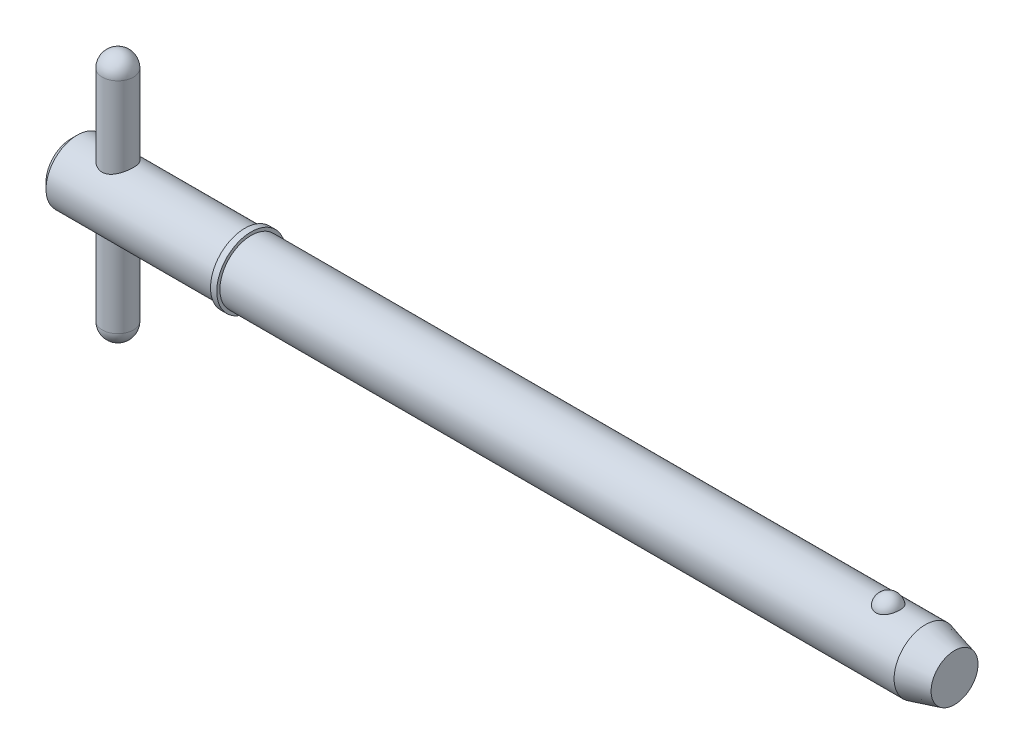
ISO-10303-21;
HEADER;
FILE_DESCRIPTION(('STEP AP214'),'2;1');
FILE_NAME('part.step','',(''),(''),'','','');
FILE_SCHEMA(('AUTOMOTIVE_DESIGN { 1 0 10303 214 1 1 1 1 }'));
ENDSEC;
DATA;
#1=APPLICATION_CONTEXT('core data for automotive mechanical design processes');
#2=APPLICATION_PROTOCOL_DEFINITION('international standard','automotive_design',2000,#1);
#3=PRODUCT_CONTEXT('',#1,'mechanical');
#4=PRODUCT('Part','Part','',(#3));
#5=PRODUCT_RELATED_PRODUCT_CATEGORY('part','',(#4));
#6=PRODUCT_DEFINITION_FORMATION('','',#4);
#7=PRODUCT_DEFINITION_CONTEXT('part definition',#1,'design');
#8=PRODUCT_DEFINITION('design','',#6,#7);
#9=PRODUCT_DEFINITION_SHAPE('','',#8);
#10=(LENGTH_UNIT() NAMED_UNIT(*) SI_UNIT(.MILLI.,.METRE.));
#11=(NAMED_UNIT(*) PLANE_ANGLE_UNIT() SI_UNIT($,.RADIAN.));
#12=(NAMED_UNIT(*) SI_UNIT($,.STERADIAN.) SOLID_ANGLE_UNIT());
#13=UNCERTAINTY_MEASURE_WITH_UNIT(LENGTH_MEASURE(1.E-05),#10,'distance_accuracy_value','');
#14=(GEOMETRIC_REPRESENTATION_CONTEXT(3) GLOBAL_UNCERTAINTY_ASSIGNED_CONTEXT((#13)) GLOBAL_UNIT_ASSIGNED_CONTEXT((#10,
#11,#12)) REPRESENTATION_CONTEXT('',''));
#15=CARTESIAN_POINT('',(0.,0.,0.));
#16=DIRECTION('',(0.,0.,1.));
#17=DIRECTION('',(1.,0.,0.));
#18=AXIS2_PLACEMENT_3D('',#15,#16,#17);
#19=CARTESIAN_POINT('',(4.755,12.7,0.));
#20=DIRECTION('',(0.,-1.,0.));
#21=DIRECTION('',(0.,0.,-1.));
#22=AXIS2_PLACEMENT_3D('',#19,#20,#21);
#23=CYLINDRICAL_SURFACE('',#22,1.585);
#24=CARTESIAN_POINT('',(4.755,-11.115,0.));
#25=DIRECTION('',(0.,-1.,0.));
#26=DIRECTION('',(0.,0.,-1.));
#27=AXIS2_PLACEMENT_3D('',#24,#25,#26);
#28=CIRCLE('',#27,1.585);
#29=CARTESIAN_POINT('',(4.755,-11.115,-1.585));
#30=VERTEX_POINT('',#29);
#31=EDGE_CURVE('P0_E10',#30,#30,#28,.F.);
#32=ORIENTED_EDGE('',*,*,#31,.T.);
#33=EDGE_LOOP('',(#32));
#34=FACE_BOUND('',#33,.T.);
#35=CARTESIAN_POINT('',(4.755,11.115,0.));
#36=DIRECTION('',(0.,-1.,0.));
#37=DIRECTION('',(0.,0.,-1.));
#38=AXIS2_PLACEMENT_3D('',#35,#36,#37);
#39=CIRCLE('',#38,1.585);
#40=CARTESIAN_POINT('',(4.755,11.115,-1.585));
#41=VERTEX_POINT('',#40);
#42=EDGE_CURVE('P0_E21',#41,#41,#39,.T.);
#43=ORIENTED_EDGE('',*,*,#42,.T.);
#44=EDGE_LOOP('',(#43));
#45=FACE_BOUND('',#44,.T.);
#46=ADVANCED_FACE('P0_F14',(#34,#45),#23,.T.);
#47=CARTESIAN_POINT('',(4.755,-11.115,0.));
#48=DIRECTION('',(0.,0.,1.));
#49=DIRECTION('',(1.,0.,0.));
#50=AXIS2_PLACEMENT_3D('',#47,#48,#49);
#51=SPHERICAL_SURFACE('',#50,1.585);
#52=CARTESIAN_POINT('',(4.755,-11.115,0.));
#53=DIRECTION('',(0.,-1.,0.));
#54=DIRECTION('',(0.,0.,-1.));
#55=AXIS2_PLACEMENT_3D('',#52,#53,#54);
#56=SPHERICAL_SURFACE('',#55,1.585);
#57=ORIENTED_EDGE('',*,*,#31,.F.);
#58=EDGE_LOOP('',(#57));
#59=FACE_BOUND('',#58,.T.);
#60=ADVANCED_FACE('P0_F29',(#59),#56,.T.);
#61=CARTESIAN_POINT('',(4.755,11.115,0.));
#62=DIRECTION('',(0.,0.,1.));
#63=DIRECTION('',(1.,0.,0.));
#64=AXIS2_PLACEMENT_3D('',#61,#62,#63);
#65=SPHERICAL_SURFACE('',#64,1.585);
#66=CARTESIAN_POINT('',(4.755,11.115,0.));
#67=DIRECTION('',(0.,-1.,0.));
#68=DIRECTION('',(0.,0.,-1.));
#69=AXIS2_PLACEMENT_3D('',#66,#67,#68);
#70=SPHERICAL_SURFACE('',#69,1.585);
#71=ORIENTED_EDGE('',*,*,#42,.F.);
#72=EDGE_LOOP('',(#71));
#73=FACE_BOUND('',#72,.T.);
#74=ADVANCED_FACE('P0_F16',(#73),#70,.T.);
#75=CLOSED_SHELL('',(#46,#60,#74));
#76=MANIFOLD_SOLID_BREP('P0_B1',#75);
#77=CARTESIAN_POINT('',(0.,0.,0.));
#78=DIRECTION('',(1.,0.,0.));
#79=DIRECTION('',(0.,0.,-1.));
#80=AXIS2_PLACEMENT_3D('',#77,#78,#79);
#81=CYLINDRICAL_SURFACE('',#80,3.175);
#82=CARTESIAN_POINT('',(86.7476846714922,0.,0.));
#83=DIRECTION('',(1.,0.,0.));
#84=DIRECTION('',(0.,0.,-1.));
#85=AXIS2_PLACEMENT_3D('',#82,#83,#84);
#86=CIRCLE('',#85,3.175);
#87=CARTESIAN_POINT('',(86.7476846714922,0.,-3.175));
#88=VERTEX_POINT('',#87);
#89=EDGE_CURVE('P1_E81',#88,#88,#86,.T.);
#90=ORIENTED_EDGE('',*,*,#89,.F.);
#91=EDGE_LOOP('',(#90));
#92=FACE_BOUND('',#91,.T.);
#93=CARTESIAN_POINT('',(18.29,0.,0.));
#94=DIRECTION('',(1.,0.,0.));
#95=DIRECTION('',(0.,0.,-1.));
#96=AXIS2_PLACEMENT_3D('',#93,#94,#95);
#97=CIRCLE('',#96,3.175);
#98=CARTESIAN_POINT('',(18.29,0.,-3.175));
#99=VERTEX_POINT('',#98);
#100=EDGE_CURVE('P1_E85',#99,#99,#97,.T.);
#101=ORIENTED_EDGE('',*,*,#100,.T.);
#102=EDGE_LOOP('',(#101));
#103=FACE_BOUND('',#102,.T.);
#104=CARTESIAN_POINT('',(82.9757276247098,2.92898950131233,1.2254164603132));
#105=CARTESIAN_POINT('',(82.912316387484,2.92899434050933,1.22541146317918));
#106=CARTESIAN_POINT('',(82.8487979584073,2.93112688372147,1.2203464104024));
#107=CARTESIAN_POINT('',(82.7235306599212,2.93942752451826,1.20020949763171));
#108=CARTESIAN_POINT('',(82.6617869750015,2.9456063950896,1.1851109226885));
#109=CARTESIAN_POINT('',(82.5420651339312,2.96127115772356,1.14540352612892));
#110=CARTESIAN_POINT('',(82.4840775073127,2.97074831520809,1.12081980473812));
#111=CARTESIAN_POINT('',(82.3731943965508,2.99197584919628,1.06285154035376));
#112=CARTESIAN_POINT('',(82.3202966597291,3.0037252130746,1.02947091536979));
#113=CARTESIAN_POINT('',(82.2192688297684,3.02865714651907,0.953674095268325));
#114=CARTESIAN_POINT('',(82.171324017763,3.04187163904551,0.911021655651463));
#115=CARTESIAN_POINT('',(82.0830360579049,3.06808741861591,0.818400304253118));
#116=CARTESIAN_POINT('',(82.0426952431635,3.08108863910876,0.768429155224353));
#117=CARTESIAN_POINT('',(81.9688039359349,3.10614903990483,0.660064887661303));
#118=CARTESIAN_POINT('',(81.9356330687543,3.11814104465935,0.601396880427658));
#119=CARTESIAN_POINT('',(81.8791190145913,3.13926931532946,0.479026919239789));
#120=CARTESIAN_POINT('',(81.8557764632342,3.14840539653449,0.415324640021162));
#121=CARTESIAN_POINT('',(81.8191785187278,3.16298160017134,0.283885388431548));
#122=CARTESIAN_POINT('',(81.8060407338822,3.16837855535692,0.216110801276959));
#123=CARTESIAN_POINT('',(81.7905676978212,3.17475386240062,0.0791367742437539));
#124=CARTESIAN_POINT('',(81.788232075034,3.17573236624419,0.00993738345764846));
#125=CARTESIAN_POINT('',(81.794388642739,3.17318075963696,-0.127420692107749));
#126=CARTESIAN_POINT('',(81.8028073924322,3.16968122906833,-0.19558325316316));
#127=CARTESIAN_POINT('',(81.8301752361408,3.1585790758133,-0.329413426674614));
#128=CARTESIAN_POINT('',(81.8491245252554,3.15097637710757,-0.395080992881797));
#129=CARTESIAN_POINT('',(81.8972057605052,3.13242485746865,-0.5221806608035));
#130=CARTESIAN_POINT('',(81.9263524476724,3.12147119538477,-0.583606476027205));
#131=CARTESIAN_POINT('',(81.9942352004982,3.09734973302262,-0.700436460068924));
#132=CARTESIAN_POINT('',(82.032972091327,3.08418174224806,-0.755840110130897));
#133=CARTESIAN_POINT('',(82.1194771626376,3.05694884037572,-0.859404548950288));
#134=CARTESIAN_POINT('',(82.1672961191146,3.04287919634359,-0.907521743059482));
#135=CARTESIAN_POINT('',(82.2707353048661,3.01548927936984,-0.994758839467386));
#136=CARTESIAN_POINT('',(82.3263549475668,3.0021689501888,-1.03387941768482));
#137=CARTESIAN_POINT('',(82.4428093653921,2.97810316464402,-1.10126594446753));
#138=CARTESIAN_POINT('',(82.5035182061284,2.96731170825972,-1.12973256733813));
#139=CARTESIAN_POINT('',(82.6293712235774,2.94928934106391,-1.17598467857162));
#140=CARTESIAN_POINT('',(82.6945137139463,2.94205708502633,-1.19377420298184));
#141=CARTESIAN_POINT('',(82.8238562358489,2.93233065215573,-1.21746387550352));
#142=CARTESIAN_POINT('',(82.8879385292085,2.92961621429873,-1.22391763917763));
#143=CARTESIAN_POINT('',(83.0163375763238,2.92855752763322,-1.22644976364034));
#144=CARTESIAN_POINT('',(83.0806542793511,2.93021238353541,-1.22253024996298));
#145=CARTESIAN_POINT('',(83.2055239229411,2.9375685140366,-1.20474140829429));
#146=CARTESIAN_POINT('',(83.266131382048,2.94313790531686,-1.19119621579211));
#147=CARTESIAN_POINT('',(83.3841106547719,2.95756226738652,-1.15491492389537));
#148=CARTESIAN_POINT('',(83.4414822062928,2.96641750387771,-1.13217808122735));
#149=CARTESIAN_POINT('',(83.5527699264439,2.98669918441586,-1.07755083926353));
#150=CARTESIAN_POINT('',(83.6065845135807,2.9981771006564,-1.0454730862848));
#151=CARTESIAN_POINT('',(83.7081473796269,3.02240235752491,-0.97322030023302));
#152=CARTESIAN_POINT('',(83.7558942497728,3.03514999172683,-0.933043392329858));
#153=CARTESIAN_POINT('',(83.8465817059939,3.06131230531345,-0.843372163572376));
#154=CARTESIAN_POINT('',(83.8891588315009,3.07472822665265,-0.793510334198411));
#155=CARTESIAN_POINT('',(83.9656765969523,3.10021106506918,-0.687241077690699));
#156=CARTESIAN_POINT('',(83.9996156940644,3.1122777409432,-0.630832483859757));
#157=CARTESIAN_POINT('',(84.0591209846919,3.134208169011,-0.51105938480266));
#158=CARTESIAN_POINT('',(84.0843892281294,3.14399040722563,-0.447531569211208));
#159=CARTESIAN_POINT('',(84.1245117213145,3.15983820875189,-0.31682749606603));
#160=CARTESIAN_POINT('',(84.1393659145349,3.16590375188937,-0.249651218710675));
#161=CARTESIAN_POINT('',(84.158358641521,3.17370076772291,-0.113549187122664));
#162=CARTESIAN_POINT('',(84.1624966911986,3.17543204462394,-0.0446233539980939));
#163=CARTESIAN_POINT('',(84.1599697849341,3.17438372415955,0.0929938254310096));
#164=CARTESIAN_POINT('',(84.1533050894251,3.17160423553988,0.16168517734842));
#165=CARTESIAN_POINT('',(84.1293754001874,3.1618438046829,0.296502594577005));
#166=CARTESIAN_POINT('',(84.1121674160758,3.15488546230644,0.362640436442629));
#167=CARTESIAN_POINT('',(84.067547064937,3.13748892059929,0.490896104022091));
#168=CARTESIAN_POINT('',(84.0401339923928,3.12705048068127,0.553013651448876));
#169=CARTESIAN_POINT('',(83.9754626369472,3.10369139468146,0.671876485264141));
#170=CARTESIAN_POINT('',(83.9381467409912,3.0907563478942,0.728587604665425));
#171=CARTESIAN_POINT('',(83.8545246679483,3.06381731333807,0.834653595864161));
#172=CARTESIAN_POINT('',(83.8082189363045,3.04981337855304,0.884008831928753));
#173=CARTESIAN_POINT('',(83.707718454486,3.02230423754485,0.973916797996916));
#174=CARTESIAN_POINT('',(83.653535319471,3.00879833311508,1.01448227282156));
#175=CARTESIAN_POINT('',(83.5385299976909,2.98383625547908,1.0857155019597));
#176=CARTESIAN_POINT('',(83.4777053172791,2.9723808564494,1.11637952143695));
#177=CARTESIAN_POINT('',(83.3533690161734,2.95329063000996,1.16592590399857));
#178=CARTESIAN_POINT('',(83.2900230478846,2.9455373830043,1.18517901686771));
#179=CARTESIAN_POINT('',(83.1607664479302,2.9342556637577,1.21284802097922));
#180=CARTESIAN_POINT('',(83.0948641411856,2.93071450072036,1.2212964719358));
#181=CARTESIAN_POINT('',(83.011116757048,2.9291525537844,1.22502505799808));
#182=CARTESIAN_POINT('',(82.9934263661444,2.92898815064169,1.22541785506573));
#183=CARTESIAN_POINT('',(82.9757276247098,2.92898950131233,1.2254164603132));
#184=B_SPLINE_CURVE_WITH_KNOTS('',3,(#104,#105,#106,#107,#108,#109,#110,#111,#112,#113,#114,
#115,#116,#117,#118,#119,#120,#121,#122,#123,#124,#125,#126,#127,#128,#129,#130,#131,#132,#133,
#134,#135,#136,#137,#138,#139,#140,#141,#142,#143,#144,#145,#146,#147,#148,#149,#150,#151,#152,
#153,#154,#155,#156,#157,#158,#159,#160,#161,#162,#163,#164,#165,#166,#167,#168,#169,#170,#171,
#172,#173,#174,#175,#176,#177,#178,#179,#180,#181,#182,#183),.UNSPECIFIED.,.T.,.F.,(4,2,2,2,2,2,
2,2,2,2,2,2,2,2,2,2,2,2,2,2,2,2,2,2,2,2,2,2,2,2,2,2,2,2,2,2,2,2,2,4),(0.,0.190186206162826,
0.380880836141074,0.571074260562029,0.761183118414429,0.956866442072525,1.15260970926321,
1.3570177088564,1.56143892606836,1.76818248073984,1.97491892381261,2.18025109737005,
2.38558707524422,2.59122111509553,2.79687285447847,3.00371012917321,3.2105318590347,
3.41323429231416,3.61586005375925,3.80828192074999,4.00066436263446,4.18685798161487,
4.37306665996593,4.56330302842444,4.75358348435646,4.95345287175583,5.15335793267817,
5.35957003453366,5.56578325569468,5.7720057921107,5.97822335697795,6.183335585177,
6.38846199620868,6.59480900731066,6.80114579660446,7.00718137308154,7.21329457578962,
7.41228022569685,7.61066481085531,7.66374777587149),.UNSPECIFIED.);
#185=CARTESIAN_POINT('',(82.9757276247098,2.92898950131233,1.2254164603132));
#186=VERTEX_POINT('',#185);
#187=EDGE_CURVE('P1_E35',#186,#186,#184,.T.);
#188=ORIENTED_EDGE('',*,*,#187,.T.);
#189=EDGE_LOOP('',(#188));
#190=FACE_BOUND('',#189,.T.);
#191=ADVANCED_FACE('P1_F13',(#92,#103,#190),#81,.T.);
#192=CARTESIAN_POINT('',(0.,0.,0.));
#193=DIRECTION('',(-1.,0.,0.));
#194=DIRECTION('',(0.,0.,1.));
#195=AXIS2_PLACEMENT_3D('',#192,#193,#194);
#196=PLANE('',#195);
#197=CARTESIAN_POINT('',(0.,0.,0.));
#198=DIRECTION('',(1.,0.,0.));
#199=DIRECTION('',(0.,0.,-1.));
#200=AXIS2_PLACEMENT_3D('',#197,#198,#199);
#201=CIRCLE('',#200,2.54);
#202=CARTESIAN_POINT('',(0.,0.,-2.54));
#203=VERTEX_POINT('',#202);
#204=EDGE_CURVE('P1_E9',#203,#203,#201,.T.);
#205=ORIENTED_EDGE('',*,*,#204,.F.);
#206=EDGE_LOOP('',(#205));
#207=FACE_BOUND('',#206,.T.);
#208=ADVANCED_FACE('P1_F15',(#207),#196,.T.);
#209=CARTESIAN_POINT('',(0.634999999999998,0.,0.));
#210=DIRECTION('',(1.,0.,0.));
#211=DIRECTION('',(0.,0.,-1.));
#212=AXIS2_PLACEMENT_3D('',#209,#210,#211);
#213=CONICAL_SURFACE('',#212,3.175,0.78539816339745);
#214=ORIENTED_EDGE('',*,*,#204,.T.);
#215=EDGE_LOOP('',(#214));
#216=FACE_BOUND('',#215,.T.);
#217=CARTESIAN_POINT('',(0.634999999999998,0.,0.));
#218=DIRECTION('',(1.,0.,0.));
#219=DIRECTION('',(0.,0.,-1.));
#220=AXIS2_PLACEMENT_3D('',#217,#218,#219);
#221=CIRCLE('',#220,3.175);
#222=CARTESIAN_POINT('',(0.634999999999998,0.,-3.175));
#223=VERTEX_POINT('',#222);
#224=EDGE_CURVE('P1_E26',#223,#223,#221,.T.);
#225=ORIENTED_EDGE('',*,*,#224,.F.);
#226=EDGE_LOOP('',(#225));
#227=FACE_BOUND('',#226,.T.);
#228=ADVANCED_FACE('P1_F77',(#216,#227),#213,.T.);
#229=CARTESIAN_POINT('',(0.,0.,0.));
#230=DIRECTION('',(1.,0.,0.));
#231=DIRECTION('',(0.,0.,-1.));
#232=AXIS2_PLACEMENT_3D('',#229,#230,#231);
#233=CYLINDRICAL_SURFACE('',#232,3.175);
#234=CARTESIAN_POINT('',(4.755,-2.75107251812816,1.585));
#235=CARTESIAN_POINT('',(4.67238891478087,-2.7510796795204,1.58499425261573));
#236=CARTESIAN_POINT('',(4.58967306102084,-2.75485010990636,1.57849830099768));
#237=CARTESIAN_POINT('',(4.42677850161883,-2.76938647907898,1.55284486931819));
#238=CARTESIAN_POINT('',(4.34660551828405,-2.78016716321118,1.53366069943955));
#239=CARTESIAN_POINT('',(4.19146029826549,-2.80716278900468,1.48366329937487));
#240=CARTESIAN_POINT('',(4.11646293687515,-2.8233488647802,1.45291173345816));
#241=CARTESIAN_POINT('',(3.97271079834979,-2.85928672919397,1.38084067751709));
#242=CARTESIAN_POINT('',(3.90395634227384,-2.87903870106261,1.33952064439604));
#243=CARTESIAN_POINT('',(3.76839976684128,-2.921867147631,1.24350234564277));
#244=CARTESIAN_POINT('',(3.702222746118,-2.94508343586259,1.18798355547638));
#245=CARTESIAN_POINT('',(3.5796334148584,-2.99109588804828,1.06685014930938));
#246=CARTESIAN_POINT('',(3.52322596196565,-3.01389183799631,1.00123054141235));
#247=CARTESIAN_POINT('',(3.41807024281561,-3.05832598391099,0.856373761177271));
#248=CARTESIAN_POINT('',(3.37009053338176,-3.07978367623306,0.776518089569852));
#249=CARTESIAN_POINT('',(3.28853137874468,-3.11730894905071,0.608596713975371));
#250=CARTESIAN_POINT('',(3.25494287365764,-3.1333799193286,0.520536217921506));
#251=CARTESIAN_POINT('',(3.20559401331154,-3.15731341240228,0.345327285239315));
#252=CARTESIAN_POINT('',(3.18873760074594,-3.16567752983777,0.258557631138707));
#253=CARTESIAN_POINT('',(3.16972238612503,-3.17512718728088,0.0830496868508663));
#254=CARTESIAN_POINT('',(3.16755472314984,-3.17621711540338,-0.00568738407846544));
#255=CARTESIAN_POINT('',(3.1775542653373,-3.17123385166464,-0.174372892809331));
#256=CARTESIAN_POINT('',(3.18849502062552,-3.16577346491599,-0.254416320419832));
#257=CARTESIAN_POINT('',(3.22220680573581,-3.14922844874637,-0.411354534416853));
#258=CARTESIAN_POINT('',(3.2449787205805,-3.13814339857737,-0.488249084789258));
#259=CARTESIAN_POINT('',(3.30185558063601,-3.111172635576,-0.638050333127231));
#260=CARTESIAN_POINT('',(3.33611332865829,-3.09522247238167,-0.710886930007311));
#261=CARTESIAN_POINT('',(3.41477890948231,-3.05996035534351,-0.849953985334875));
#262=CARTESIAN_POINT('',(3.45919037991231,-3.04064719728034,-0.916182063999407));
#263=CARTESIAN_POINT('',(3.5617148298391,-2.99832415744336,-1.04681642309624));
#264=CARTESIAN_POINT('',(3.62072497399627,-2.97513741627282,-1.11046186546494));
#265=CARTESIAN_POINT('',(3.7483697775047,-2.92885066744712,-1.22736291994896));
#266=CARTESIAN_POINT('',(3.81701173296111,-2.90575073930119,-1.2806105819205));
#267=CARTESIAN_POINT('',(3.96727993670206,-2.86067370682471,-1.37849835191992));
#268=CARTESIAN_POINT('',(4.04945242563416,-2.83885964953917,-1.42238246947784));
#269=CARTESIAN_POINT('',(4.2213558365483,-2.80110454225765,-1.49537418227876));
#270=CARTESIAN_POINT('',(4.3110787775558,-2.78515738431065,-1.52449715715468));
#271=CARTESIAN_POINT('',(4.48806324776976,-2.76271292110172,-1.56478065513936));
#272=CARTESIAN_POINT('',(4.57495732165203,-2.75556745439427,-1.57718067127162));
#273=CARTESIAN_POINT('',(4.74985771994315,-2.74969306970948,-1.58740564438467));
#274=CARTESIAN_POINT('',(4.8378632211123,-2.75095824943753,-1.58524082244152));
#275=CARTESIAN_POINT('',(5.00227282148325,-2.76107477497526,-1.56753530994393));
#276=CARTESIAN_POINT('',(5.07889680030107,-2.76908515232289,-1.55347662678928));
#277=CARTESIAN_POINT('',(5.22855309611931,-2.79054849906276,-1.51458035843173));
#278=CARTESIAN_POINT('',(5.30158424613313,-2.80400322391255,-1.489739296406));
#279=CARTESIAN_POINT('',(5.44583114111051,-2.83556995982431,-1.42877335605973));
#280=CARTESIAN_POINT('',(5.51680600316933,-2.85386886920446,-1.39217900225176));
#281=CARTESIAN_POINT('',(5.6520174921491,-2.89289503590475,-1.30915485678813));
#282=CARTESIAN_POINT('',(5.71625063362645,-2.91362353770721,-1.26272001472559));
#283=CARTESIAN_POINT('',(5.8445938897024,-2.95830220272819,-1.15451693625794));
#284=CARTESIAN_POINT('',(5.90767560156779,-2.98233004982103,-1.09155543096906));
#285=CARTESIAN_POINT('',(6.0226995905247,-3.02864458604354,-0.955560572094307));
#286=CARTESIAN_POINT('',(6.07463814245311,-3.05093069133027,-0.882523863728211));
#287=CARTESIAN_POINT('',(6.16704288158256,-3.09200671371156,-0.725836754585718));
#288=CARTESIAN_POINT('',(6.20717458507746,-3.11069030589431,-0.64195924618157));
#289=CARTESIAN_POINT('',(6.27235859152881,-3.1416474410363,-0.467442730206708));
#290=CARTESIAN_POINT('',(6.29742409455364,-3.15392659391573,-0.376809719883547));
#291=CARTESIAN_POINT('',(6.32960989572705,-3.16979844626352,-0.200314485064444));
#292=CARTESIAN_POINT('',(6.33816324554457,-3.17408359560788,-0.114775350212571));
#293=CARTESIAN_POINT('',(6.34130309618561,-3.17565001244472,0.0566108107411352));
#294=CARTESIAN_POINT('',(6.33589445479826,-3.17293371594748,0.142457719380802));
#295=CARTESIAN_POINT('',(6.31221457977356,-3.16120608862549,0.306097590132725));
#296=CARTESIAN_POINT('',(6.2948097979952,-3.15261910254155,0.38404960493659));
#297=CARTESIAN_POINT('',(6.24879775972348,-3.13040364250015,0.535801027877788));
#298=CARTESIAN_POINT('',(6.22018889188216,-3.11677444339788,0.609599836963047));
#299=CARTESIAN_POINT('',(6.15130303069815,-3.08497808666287,0.754502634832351));
#300=CARTESIAN_POINT('',(6.11057850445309,-3.0666414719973,0.82535556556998));
#301=CARTESIAN_POINT('',(6.01917980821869,-3.02735012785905,0.95951596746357));
#302=CARTESIAN_POINT('',(5.96850106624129,-3.00639419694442,1.02281994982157));
#303=CARTESIAN_POINT('',(5.8528006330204,-2.96149402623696,1.1467073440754));
#304=CARTESIAN_POINT('',(5.78685463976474,-2.93745961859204,1.20639723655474));
#305=CARTESIAN_POINT('',(5.64552278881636,-2.89084502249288,1.31419099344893));
#306=CARTESIAN_POINT('',(5.57012871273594,-2.8682661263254,1.36228466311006));
#307=CARTESIAN_POINT('',(5.40892145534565,-2.82661780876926,1.44677201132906));
#308=CARTESIAN_POINT('',(5.32285703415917,-2.80767948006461,1.48275497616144));
#309=CARTESIAN_POINT('',(5.14469010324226,-2.77716572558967,1.53916557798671));
#310=CARTESIAN_POINT('',(5.05260892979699,-2.76556569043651,1.55964525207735));
#311=CARTESIAN_POINT('',(4.92544162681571,-2.75613775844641,1.57618070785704));
#312=CARTESIAN_POINT('',(4.89147210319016,-2.75424493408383,1.57948285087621));
#313=CARTESIAN_POINT('',(4.82334103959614,-2.75171079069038,1.58389375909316));
#314=CARTESIAN_POINT('',(4.78917948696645,-2.75106955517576,1.58500237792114));
#315=CARTESIAN_POINT('',(4.755,-2.75107251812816,1.585));
#316=B_SPLINE_CURVE_WITH_KNOTS('',3,(#234,#235,#236,#237,#238,#239,#240,#241,#242,#243,#244,
#245,#246,#247,#248,#249,#250,#251,#252,#253,#254,#255,#256,#257,#258,#259,#260,#261,#262,#263,
#264,#265,#266,#267,#268,#269,#270,#271,#272,#273,#274,#275,#276,#277,#278,#279,#280,#281,#282,
#283,#284,#285,#286,#287,#288,#289,#290,#291,#292,#293,#294,#295,#296,#297,#298,#299,#300,#301,
#302,#303,#304,#305,#306,#307,#308,#309,#310,#311,#312,#313,#314,#315),.UNSPECIFIED.,.T.,.F.,(4,
2,2,2,2,2,2,2,2,2,2,2,2,2,2,2,2,2,2,2,2,2,2,2,2,2,2,2,2,2,2,2,2,2,2,2,2,2,2,2,4),(0.,
0.247689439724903,0.495901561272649,0.742808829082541,0.989728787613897,1.25694656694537,
1.52429683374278,1.80959781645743,2.0947189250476,2.35960564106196,2.62433255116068,
2.86610932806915,3.1079041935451,3.35305262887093,3.59828902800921,3.86665310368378,
4.13522157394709,4.4207514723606,4.70598326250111,4.9686344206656,5.23110127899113,
5.46499114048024,5.69895647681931,5.94376186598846,6.1886932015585,6.46438263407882,
6.74016408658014,7.0231370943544,7.30586181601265,7.5626977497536,7.81944433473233,
8.05935987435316,8.29930993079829,8.54954401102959,8.79989329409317,9.07508848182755,
9.35052473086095,9.63453318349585,9.91758407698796,10.0200561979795,10.1225351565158),.UNSPECIFIED.);
#317=CARTESIAN_POINT('',(4.755,-2.75107251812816,1.585));
#318=VERTEX_POINT('',#317);
#319=EDGE_CURVE('P1_E17',#318,#318,#316,.T.);
#320=ORIENTED_EDGE('',*,*,#319,.F.);
#321=EDGE_LOOP('',(#320));
#322=FACE_BOUND('',#321,.T.);
#323=CARTESIAN_POINT('',(4.755,2.75107251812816,1.585));
#324=CARTESIAN_POINT('',(4.83761108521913,2.7510796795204,1.58499425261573));
#325=CARTESIAN_POINT('',(4.92032693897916,2.75485010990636,1.57849830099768));
#326=CARTESIAN_POINT('',(5.08322149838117,2.76938647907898,1.55284486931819));
#327=CARTESIAN_POINT('',(5.16339448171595,2.78016716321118,1.53366069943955));
#328=CARTESIAN_POINT('',(5.31853970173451,2.80716278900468,1.48366329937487));
#329=CARTESIAN_POINT('',(5.39353706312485,2.8233488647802,1.45291173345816));
#330=CARTESIAN_POINT('',(5.53728920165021,2.85928672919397,1.38084067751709));
#331=CARTESIAN_POINT('',(5.60604365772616,2.87903870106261,1.33952064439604));
#332=CARTESIAN_POINT('',(5.74160023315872,2.921867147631,1.24350234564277));
#333=CARTESIAN_POINT('',(5.807777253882,2.94508343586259,1.18798355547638));
#334=CARTESIAN_POINT('',(5.9303665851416,2.99109588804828,1.06685014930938));
#335=CARTESIAN_POINT('',(5.98677403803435,3.01389183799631,1.00123054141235));
#336=CARTESIAN_POINT('',(6.09192975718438,3.05832598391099,0.85637376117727));
#337=CARTESIAN_POINT('',(6.13990946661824,3.07978367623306,0.776518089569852));
#338=CARTESIAN_POINT('',(6.22146862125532,3.11730894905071,0.608596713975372));
#339=CARTESIAN_POINT('',(6.25505712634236,3.1333799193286,0.520536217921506));
#340=CARTESIAN_POINT('',(6.30440598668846,3.15731341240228,0.345327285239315));
#341=CARTESIAN_POINT('',(6.32126239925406,3.16567752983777,0.258557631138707));
#342=CARTESIAN_POINT('',(6.34027761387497,3.17512718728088,0.0830496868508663));
#343=CARTESIAN_POINT('',(6.34244527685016,3.17621711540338,-0.00568738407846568));
#344=CARTESIAN_POINT('',(6.3324457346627,3.17123385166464,-0.174372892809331));
#345=CARTESIAN_POINT('',(6.32150497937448,3.16577346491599,-0.254416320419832));
#346=CARTESIAN_POINT('',(6.28779319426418,3.14922844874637,-0.411354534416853));
#347=CARTESIAN_POINT('',(6.2650212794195,3.13814339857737,-0.488249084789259));
#348=CARTESIAN_POINT('',(6.20814441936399,3.111172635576,-0.638050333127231));
#349=CARTESIAN_POINT('',(6.17388667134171,3.09522247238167,-0.710886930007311));
#350=CARTESIAN_POINT('',(6.09522109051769,3.05996035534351,-0.849953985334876));
#351=CARTESIAN_POINT('',(6.05080962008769,3.04064719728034,-0.916182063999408));
#352=CARTESIAN_POINT('',(5.9482851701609,2.99832415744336,-1.04681642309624));
#353=CARTESIAN_POINT('',(5.88927502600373,2.97513741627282,-1.11046186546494));
#354=CARTESIAN_POINT('',(5.7616302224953,2.92885066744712,-1.22736291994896));
#355=CARTESIAN_POINT('',(5.69298826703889,2.90575073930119,-1.2806105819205));
#356=CARTESIAN_POINT('',(5.54272006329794,2.86067370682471,-1.37849835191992));
#357=CARTESIAN_POINT('',(5.46054757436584,2.83885964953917,-1.42238246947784));
#358=CARTESIAN_POINT('',(5.2886441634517,2.80110454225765,-1.49537418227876));
#359=CARTESIAN_POINT('',(5.19892122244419,2.78515738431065,-1.52449715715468));
#360=CARTESIAN_POINT('',(5.02193675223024,2.76271292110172,-1.56478065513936));
#361=CARTESIAN_POINT('',(4.93504267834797,2.75556745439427,-1.57718067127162));
#362=CARTESIAN_POINT('',(4.76014228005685,2.74969306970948,-1.58740564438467));
#363=CARTESIAN_POINT('',(4.6721367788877,2.75095824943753,-1.58524082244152));
#364=CARTESIAN_POINT('',(4.50772717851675,2.76107477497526,-1.56753530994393));
#365=CARTESIAN_POINT('',(4.43110319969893,2.76908515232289,-1.55347662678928));
#366=CARTESIAN_POINT('',(4.28144690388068,2.79054849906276,-1.51458035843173));
#367=CARTESIAN_POINT('',(4.20841575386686,2.80400322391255,-1.489739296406));
#368=CARTESIAN_POINT('',(4.06416885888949,2.83556995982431,-1.42877335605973));
#369=CARTESIAN_POINT('',(3.99319399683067,2.85386886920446,-1.39217900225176));
#370=CARTESIAN_POINT('',(3.8579825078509,2.89289503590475,-1.30915485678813));
#371=CARTESIAN_POINT('',(3.79374936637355,2.91362353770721,-1.26272001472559));
#372=CARTESIAN_POINT('',(3.6654061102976,2.95830220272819,-1.15451693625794));
#373=CARTESIAN_POINT('',(3.60232439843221,2.98233004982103,-1.09155543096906));
#374=CARTESIAN_POINT('',(3.4873004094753,3.02864458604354,-0.955560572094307));
#375=CARTESIAN_POINT('',(3.43536185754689,3.05093069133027,-0.88252386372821));
#376=CARTESIAN_POINT('',(3.34295711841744,3.09200671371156,-0.725836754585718));
#377=CARTESIAN_POINT('',(3.30282541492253,3.11069030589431,-0.64195924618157));
#378=CARTESIAN_POINT('',(3.23764140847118,3.14164744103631,-0.467442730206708));
#379=CARTESIAN_POINT('',(3.21257590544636,3.15392659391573,-0.376809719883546));
#380=CARTESIAN_POINT('',(3.18039010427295,3.16979844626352,-0.200314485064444));
#381=CARTESIAN_POINT('',(3.17183675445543,3.17408359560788,-0.114775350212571));
#382=CARTESIAN_POINT('',(3.16869690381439,3.17565001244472,0.0566108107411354));
#383=CARTESIAN_POINT('',(3.17410554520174,3.17293371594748,0.142457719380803));
#384=CARTESIAN_POINT('',(3.19778542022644,3.16120608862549,0.306097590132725));
#385=CARTESIAN_POINT('',(3.2151902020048,3.15261910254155,0.384049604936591));
#386=CARTESIAN_POINT('',(3.26120224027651,3.13040364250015,0.535801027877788));
#387=CARTESIAN_POINT('',(3.28981110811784,3.11677444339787,0.609599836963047));
#388=CARTESIAN_POINT('',(3.35869696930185,3.08497808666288,0.754502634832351));
#389=CARTESIAN_POINT('',(3.39942149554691,3.0666414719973,0.82535556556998));
#390=CARTESIAN_POINT('',(3.49082019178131,3.02735012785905,0.95951596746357));
#391=CARTESIAN_POINT('',(3.54149893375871,3.00639419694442,1.02281994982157));
#392=CARTESIAN_POINT('',(3.6571993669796,2.96149402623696,1.1467073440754));
#393=CARTESIAN_POINT('',(3.72314536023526,2.93745961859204,1.20639723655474));
#394=CARTESIAN_POINT('',(3.86447721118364,2.89084502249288,1.31419099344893));
#395=CARTESIAN_POINT('',(3.93987128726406,2.8682661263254,1.36228466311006));
#396=CARTESIAN_POINT('',(4.10107854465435,2.82661780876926,1.44677201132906));
#397=CARTESIAN_POINT('',(4.18714296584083,2.80767948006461,1.48275497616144));
#398=CARTESIAN_POINT('',(4.36530989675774,2.77716572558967,1.53916557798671));
#399=CARTESIAN_POINT('',(4.45739107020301,2.76556569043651,1.55964525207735));
#400=CARTESIAN_POINT('',(4.58455837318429,2.75613775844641,1.57618070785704));
#401=CARTESIAN_POINT('',(4.61852789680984,2.75424493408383,1.57948285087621));
#402=CARTESIAN_POINT('',(4.68665896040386,2.75171079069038,1.58389375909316));
#403=CARTESIAN_POINT('',(4.72082051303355,2.75106955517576,1.58500237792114));
#404=CARTESIAN_POINT('',(4.755,2.75107251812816,1.585));
#405=B_SPLINE_CURVE_WITH_KNOTS('',3,(#323,#324,#325,#326,#327,#328,#329,#330,#331,#332,#333,
#334,#335,#336,#337,#338,#339,#340,#341,#342,#343,#344,#345,#346,#347,#348,#349,#350,#351,#352,
#353,#354,#355,#356,#357,#358,#359,#360,#361,#362,#363,#364,#365,#366,#367,#368,#369,#370,#371,
#372,#373,#374,#375,#376,#377,#378,#379,#380,#381,#382,#383,#384,#385,#386,#387,#388,#389,#390,
#391,#392,#393,#394,#395,#396,#397,#398,#399,#400,#401,#402,#403,#404),.UNSPECIFIED.,.T.,.F.,(4,
2,2,2,2,2,2,2,2,2,2,2,2,2,2,2,2,2,2,2,2,2,2,2,2,2,2,2,2,2,2,2,2,2,2,2,2,2,2,2,4),(0.,
0.247689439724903,0.495901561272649,0.742808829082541,0.989728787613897,1.25694656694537,
1.52429683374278,1.80959781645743,2.0947189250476,2.35960564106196,2.62433255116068,
2.86610932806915,3.1079041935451,3.35305262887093,3.59828902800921,3.86665310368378,
4.13522157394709,4.4207514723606,4.70598326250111,4.9686344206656,5.23110127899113,
5.46499114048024,5.69895647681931,5.94376186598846,6.1886932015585,6.46438263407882,
6.74016408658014,7.0231370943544,7.30586181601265,7.5626977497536,7.81944433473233,
8.05935987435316,8.29930993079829,8.54954401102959,8.79989329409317,9.07508848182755,
9.35052473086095,9.63453318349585,9.91758407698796,10.0200561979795,10.1225351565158),.UNSPECIFIED.);
#406=CARTESIAN_POINT('',(4.755,2.75107251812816,1.585));
#407=VERTEX_POINT('',#406);
#408=EDGE_CURVE('P1_E43',#407,#407,#405,.T.);
#409=ORIENTED_EDGE('',*,*,#408,.F.);
#410=EDGE_LOOP('',(#409));
#411=FACE_BOUND('',#410,.T.);
#412=ORIENTED_EDGE('',*,*,#224,.T.);
#413=EDGE_LOOP('',(#412));
#414=FACE_BOUND('',#413,.T.);
#415=CARTESIAN_POINT('',(17.655,0.,0.));
#416=DIRECTION('',(1.,0.,0.));
#417=DIRECTION('',(0.,0.,-1.));
#418=AXIS2_PLACEMENT_3D('',#415,#416,#417);
#419=CIRCLE('',#418,3.175);
#420=CARTESIAN_POINT('',(17.655,0.,-3.175));
#421=VERTEX_POINT('',#420);
#422=EDGE_CURVE('P1_E31',#421,#421,#419,.T.);
#423=ORIENTED_EDGE('',*,*,#422,.F.);
#424=EDGE_LOOP('',(#423));
#425=FACE_BOUND('',#424,.T.);
#426=ADVANCED_FACE('P1_F103',(#322,#411,#414,#425),#233,.T.);
#427=CARTESIAN_POINT('',(17.655,3.175,0.));
#428=DIRECTION('',(-1.,0.,0.));
#429=DIRECTION('',(0.,0.,1.));
#430=AXIS2_PLACEMENT_3D('',#427,#428,#429);
#431=PLANE('',#430);
#432=ORIENTED_EDGE('',*,*,#422,.T.);
#433=EDGE_LOOP('',(#432));
#434=FACE_BOUND('',#433,.T.);
#435=CARTESIAN_POINT('',(17.655,0.,0.));
#436=DIRECTION('',(1.,0.,0.));
#437=DIRECTION('',(0.,0.,-1.));
#438=AXIS2_PLACEMENT_3D('',#435,#436,#437);
#439=CIRCLE('',#438,3.4925);
#440=CARTESIAN_POINT('',(17.655,0.,-3.4925));
#441=VERTEX_POINT('',#440);
#442=EDGE_CURVE('P1_E91',#441,#441,#439,.T.);
#443=ORIENTED_EDGE('',*,*,#442,.F.);
#444=EDGE_LOOP('',(#443));
#445=FACE_BOUND('',#444,.T.);
#446=ADVANCED_FACE('P1_F100',(#434,#445),#431,.T.);
#447=CARTESIAN_POINT('',(0.,0.,0.));
#448=DIRECTION('',(1.,0.,0.));
#449=DIRECTION('',(0.,0.,-1.));
#450=AXIS2_PLACEMENT_3D('',#447,#448,#449);
#451=CYLINDRICAL_SURFACE('',#450,3.4925);
#452=ORIENTED_EDGE('',*,*,#442,.T.);
#453=EDGE_LOOP('',(#452));
#454=FACE_BOUND('',#453,.T.);
#455=CARTESIAN_POINT('',(18.29,0.,0.));
#456=DIRECTION('',(1.,0.,0.));
#457=DIRECTION('',(0.,0.,-1.));
#458=AXIS2_PLACEMENT_3D('',#455,#456,#457);
#459=CIRCLE('',#458,3.4925);
#460=CARTESIAN_POINT('',(18.29,0.,-3.4925));
#461=VERTEX_POINT('',#460);
#462=EDGE_CURVE('P1_E88',#461,#461,#459,.T.);
#463=ORIENTED_EDGE('',*,*,#462,.F.);
#464=EDGE_LOOP('',(#463));
#465=FACE_BOUND('',#464,.T.);
#466=ADVANCED_FACE('P1_F68',(#454,#465),#451,.T.);
#467=CARTESIAN_POINT('',(18.29,3.4925,0.));
#468=DIRECTION('',(1.,0.,0.));
#469=DIRECTION('',(0.,0.,-1.));
#470=AXIS2_PLACEMENT_3D('',#467,#468,#469);
#471=PLANE('',#470);
#472=ORIENTED_EDGE('',*,*,#462,.T.);
#473=EDGE_LOOP('',(#472));
#474=FACE_BOUND('',#473,.T.);
#475=ORIENTED_EDGE('',*,*,#100,.F.);
#476=EDGE_LOOP('',(#475));
#477=FACE_BOUND('',#476,.T.);
#478=ADVANCED_FACE('P1_F62',(#474,#477),#471,.T.);
#479=CARTESIAN_POINT('',(89.71,0.,0.));
#480=DIRECTION('',(-1.,0.,0.));
#481=DIRECTION('',(0.,0.,1.));
#482=AXIS2_PLACEMENT_3D('',#479,#480,#481);
#483=CONICAL_SURFACE('',#482,2.38125000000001,0.26179938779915);
#484=ORIENTED_EDGE('',*,*,#89,.T.);
#485=EDGE_LOOP('',(#484));
#486=FACE_BOUND('',#485,.T.);
#487=CARTESIAN_POINT('',(89.71,0.,0.));
#488=DIRECTION('',(1.,0.,0.));
#489=DIRECTION('',(0.,0.,-1.));
#490=AXIS2_PLACEMENT_3D('',#487,#488,#489);
#491=CIRCLE('',#490,2.38125000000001);
#492=CARTESIAN_POINT('',(89.71,0.,-2.38125000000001));
#493=VERTEX_POINT('',#492);
#494=EDGE_CURVE('P1_E42',#493,#493,#491,.T.);
#495=ORIENTED_EDGE('',*,*,#494,.F.);
#496=EDGE_LOOP('',(#495));
#497=FACE_BOUND('',#496,.T.);
#498=ADVANCED_FACE('P1_F59',(#486,#497),#483,.T.);
#499=CARTESIAN_POINT('',(89.71,2.38125000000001,0.));
#500=DIRECTION('',(1.,0.,0.));
#501=DIRECTION('',(0.,0.,-1.));
#502=AXIS2_PLACEMENT_3D('',#499,#500,#501);
#503=PLANE('',#502);
#504=ORIENTED_EDGE('',*,*,#494,.T.);
#505=EDGE_LOOP('',(#504));
#506=FACE_BOUND('',#505,.T.);
#507=ADVANCED_FACE('P1_F55',(#506),#503,.T.);
#508=CARTESIAN_POINT('',(82.9757276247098,2.8575,0.));
#509=DIRECTION('',(-1.,0.,0.));
#510=DIRECTION('',(0.,1.,0.));
#511=AXIS2_PLACEMENT_3D('',#508,#509,#510);
#512=SPHERICAL_SURFACE('',#511,1.22750000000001);
#513=ORIENTED_EDGE('',*,*,#187,.F.);
#514=EDGE_LOOP('',(#513));
#515=FACE_BOUND('',#514,.T.);
#516=ADVANCED_FACE('P1_F50',(#515),#512,.T.);
#517=CARTESIAN_POINT('',(4.755,-3.4925,0.));
#518=DIRECTION('',(0.,1.,0.));
#519=DIRECTION('',(0.,0.,1.));
#520=AXIS2_PLACEMENT_3D('',#517,#518,#519);
#521=CYLINDRICAL_SURFACE('',#520,1.585);
#522=ORIENTED_EDGE('',*,*,#319,.T.);
#523=EDGE_LOOP('',(#522));
#524=FACE_BOUND('',#523,.T.);
#525=ORIENTED_EDGE('',*,*,#408,.T.);
#526=EDGE_LOOP('',(#525));
#527=FACE_BOUND('',#526,.T.);
#528=ADVANCED_FACE('P1_F54',(#524,#527),#521,.F.);
#529=CLOSED_SHELL('',(#191,#208,#228,#426,#446,#466,#478,#498,#507,#516,#528));
#530=MANIFOLD_SOLID_BREP('P1_B1',#529);
#531=ADVANCED_BREP_SHAPE_REPRESENTATION('',(#18,#76,#530),#14);
#532=SHAPE_DEFINITION_REPRESENTATION(#9,#531);
ENDSEC;
END-ISO-10303-21;
